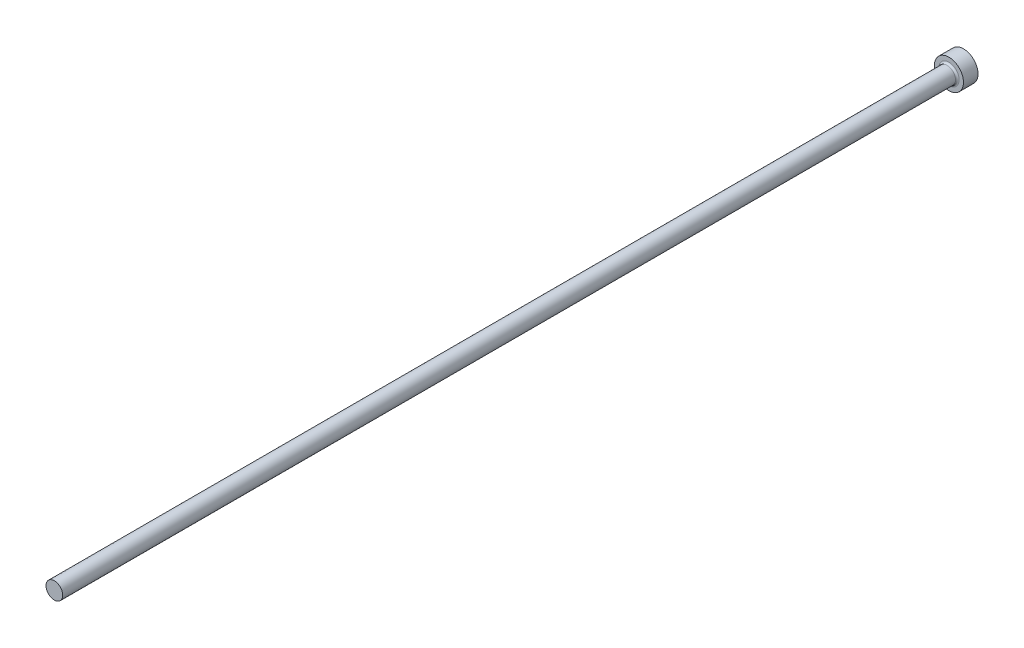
ISO-10303-21;
HEADER;
FILE_DESCRIPTION(('STEP AP214'),'2;1');
FILE_NAME('part.step','',(''),(''),'','','');
FILE_SCHEMA(('AUTOMOTIVE_DESIGN { 1 0 10303 214 1 1 1 1 }'));
ENDSEC;
DATA;
#1=APPLICATION_CONTEXT('core data for automotive mechanical design processes');
#2=APPLICATION_PROTOCOL_DEFINITION('international standard','automotive_design',2000,#1);
#3=PRODUCT_CONTEXT('',#1,'mechanical');
#4=PRODUCT('Part','Part','',(#3));
#5=PRODUCT_RELATED_PRODUCT_CATEGORY('part','',(#4));
#6=PRODUCT_DEFINITION_FORMATION('','',#4);
#7=PRODUCT_DEFINITION_CONTEXT('part definition',#1,'design');
#8=PRODUCT_DEFINITION('design','',#6,#7);
#9=PRODUCT_DEFINITION_SHAPE('','',#8);
#10=(LENGTH_UNIT() NAMED_UNIT(*) SI_UNIT(.MILLI.,.METRE.));
#11=(NAMED_UNIT(*) PLANE_ANGLE_UNIT() SI_UNIT($,.RADIAN.));
#12=(NAMED_UNIT(*) SI_UNIT($,.STERADIAN.) SOLID_ANGLE_UNIT());
#13=UNCERTAINTY_MEASURE_WITH_UNIT(LENGTH_MEASURE(1.E-05),#10,'distance_accuracy_value','');
#14=(GEOMETRIC_REPRESENTATION_CONTEXT(3) GLOBAL_UNCERTAINTY_ASSIGNED_CONTEXT((#13)) GLOBAL_UNIT_ASSIGNED_CONTEXT((#10,
#11,#12)) REPRESENTATION_CONTEXT('',''));
#15=CARTESIAN_POINT('',(0.,0.,0.));
#16=DIRECTION('',(0.,0.,1.));
#17=DIRECTION('',(1.,0.,0.));
#18=AXIS2_PLACEMENT_3D('',#15,#16,#17);
#19=CARTESIAN_POINT('',(4.,0.,4.));
#20=DIRECTION('',(0.,0.,-1.));
#21=DIRECTION('',(-1.,0.,0.));
#22=AXIS2_PLACEMENT_3D('',#19,#20,#21);
#23=PLANE('',#22);
#24=CARTESIAN_POINT('',(0.,0.,4.));
#25=DIRECTION('',(0.,0.,-1.));
#26=DIRECTION('',(-1.,0.,0.));
#27=AXIS2_PLACEMENT_3D('',#24,#25,#26);
#28=CIRCLE('',#27,2.80000000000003);
#29=CARTESIAN_POINT('',(-2.80000000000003,0.,4.));
#30=VERTEX_POINT('',#29);
#31=EDGE_CURVE('E40',#30,#30,#28,.T.);
#32=ORIENTED_EDGE('',*,*,#31,.T.);
#33=EDGE_LOOP('',(#32));
#34=FACE_BOUND('',#33,.T.);
#35=CARTESIAN_POINT('',(0.,0.,4.));
#36=DIRECTION('',(0.,0.,-1.));
#37=DIRECTION('',(-1.,0.,0.));
#38=AXIS2_PLACEMENT_3D('',#35,#36,#37);
#39=CIRCLE('',#38,4.);
#40=CARTESIAN_POINT('',(-4.,0.,4.));
#41=VERTEX_POINT('',#40);
#42=EDGE_CURVE('E44',#41,#41,#39,.T.);
#43=ORIENTED_EDGE('',*,*,#42,.F.);
#44=EDGE_LOOP('',(#43));
#45=FACE_BOUND('',#44,.T.);
#46=ADVANCED_FACE('F33',(#34,#45),#23,.F.);
#47=CARTESIAN_POINT('',(0.,0.,-9.03322817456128));
#48=DIRECTION('',(0.,0.,-1.));
#49=DIRECTION('',(-1.,0.,0.));
#50=AXIS2_PLACEMENT_3D('',#47,#48,#49);
#51=CYLINDRICAL_SURFACE('',#50,4.);
#52=CARTESIAN_POINT('',(0.,0.,0.));
#53=DIRECTION('',(0.,0.,-1.));
#54=DIRECTION('',(-1.,0.,0.));
#55=AXIS2_PLACEMENT_3D('',#52,#53,#54);
#56=CIRCLE('',#55,4.);
#57=CARTESIAN_POINT('',(-4.,0.,0.));
#58=VERTEX_POINT('',#57);
#59=EDGE_CURVE('E48',#58,#58,#56,.T.);
#60=ORIENTED_EDGE('',*,*,#59,.F.);
#61=EDGE_LOOP('',(#60));
#62=FACE_BOUND('',#61,.T.);
#63=ORIENTED_EDGE('',*,*,#42,.T.);
#64=EDGE_LOOP('',(#63));
#65=FACE_BOUND('',#64,.T.);
#66=ADVANCED_FACE('F68',(#62,#65),#51,.T.);
#67=CARTESIAN_POINT('',(0.,0.,0.));
#68=DIRECTION('',(0.,0.,1.));
#69=DIRECTION('',(1.,0.,0.));
#70=AXIS2_PLACEMENT_3D('',#67,#68,#69);
#71=PLANE('',#70);
#72=ORIENTED_EDGE('',*,*,#59,.T.);
#73=EDGE_LOOP('',(#72));
#74=FACE_BOUND('',#73,.T.);
#75=ADVANCED_FACE('F61',(#74),#71,.F.);
#76=CARTESIAN_POINT('',(0.,0.,250.));
#77=DIRECTION('',(0.,0.,-1.));
#78=DIRECTION('',(-1.,0.,0.));
#79=AXIS2_PLACEMENT_3D('',#76,#77,#78);
#80=PLANE('',#79);
#81=CARTESIAN_POINT('',(0.,0.,250.));
#82=DIRECTION('',(0.,0.,-1.));
#83=DIRECTION('',(-1.,0.,0.));
#84=AXIS2_PLACEMENT_3D('',#81,#82,#83);
#85=CIRCLE('',#84,2.30000000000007);
#86=CARTESIAN_POINT('',(-2.30000000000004,0.,250.));
#87=VERTEX_POINT('',#86);
#88=EDGE_CURVE('E53',#87,#87,#85,.T.);
#89=ORIENTED_EDGE('',*,*,#88,.F.);
#90=EDGE_LOOP('',(#89));
#91=FACE_BOUND('',#90,.T.);
#92=ADVANCED_FACE('F59',(#91),#80,.F.);
#93=CARTESIAN_POINT('',(0.,0.,-9.03322817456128));
#94=DIRECTION('',(0.,0.,-1.));
#95=DIRECTION('',(-1.,0.,0.));
#96=AXIS2_PLACEMENT_3D('',#93,#94,#95);
#97=CYLINDRICAL_SURFACE('',#96,2.30000000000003);
#98=CARTESIAN_POINT('',(0.,0.,4.5));
#99=DIRECTION('',(0.,0.,-1.));
#100=DIRECTION('',(-1.,0.,0.));
#101=AXIS2_PLACEMENT_3D('',#98,#99,#100);
#102=CIRCLE('',#101,2.30000000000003);
#103=CARTESIAN_POINT('',(-2.30000000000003,0.,4.5));
#104=VERTEX_POINT('',#103);
#105=EDGE_CURVE('E10',#104,#104,#102,.F.);
#106=ORIENTED_EDGE('',*,*,#105,.T.);
#107=EDGE_LOOP('',(#106));
#108=FACE_BOUND('',#107,.T.);
#109=ORIENTED_EDGE('',*,*,#88,.T.);
#110=EDGE_LOOP('',(#109));
#111=FACE_BOUND('',#110,.T.);
#112=ADVANCED_FACE('F57',(#108,#111),#97,.T.);
#113=CARTESIAN_POINT('',(0.,0.,4.5));
#114=DIRECTION('',(0.,0.,-1.));
#115=DIRECTION('',(-1.,0.,0.));
#116=AXIS2_PLACEMENT_3D('',#113,#114,#115);
#117=TOROIDAL_SURFACE('',#116,2.80000000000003,0.5);
#118=ORIENTED_EDGE('',*,*,#105,.F.);
#119=EDGE_LOOP('',(#118));
#120=FACE_BOUND('',#119,.T.);
#121=ORIENTED_EDGE('',*,*,#31,.F.);
#122=EDGE_LOOP('',(#121));
#123=FACE_BOUND('',#122,.T.);
#124=ADVANCED_FACE('F35',(#120,#123),#117,.F.);
#125=CLOSED_SHELL('',(#46,#66,#75,#92,#112,#124));
#126=MANIFOLD_SOLID_BREP('B2',#125);
#127=ADVANCED_BREP_SHAPE_REPRESENTATION('',(#18,#126),#14);
#128=SHAPE_DEFINITION_REPRESENTATION(#9,#127);
ENDSEC;
END-ISO-10303-21;
